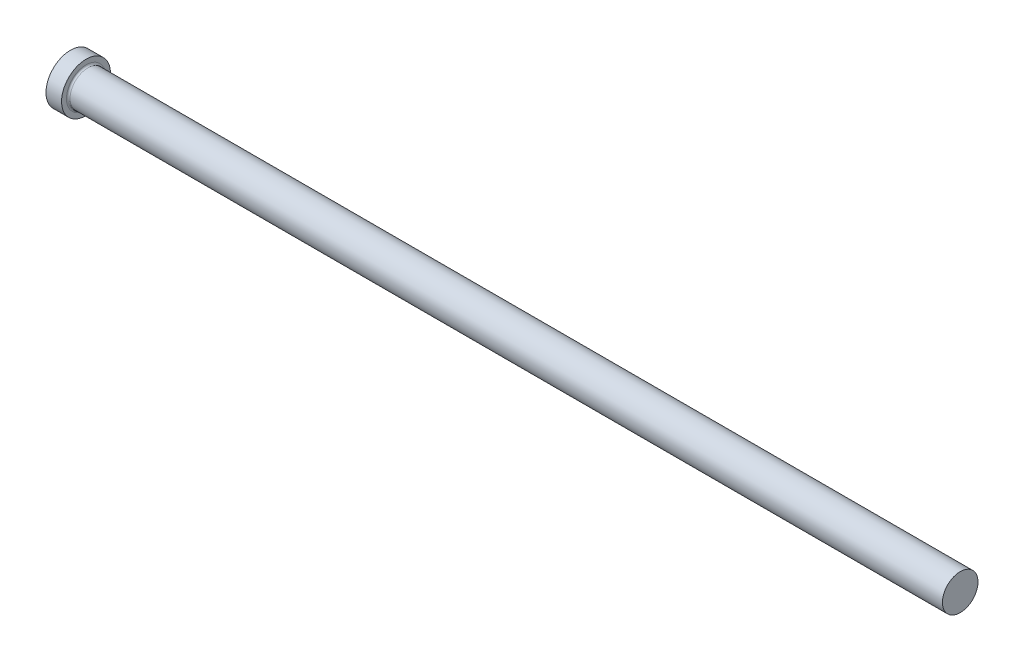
ISO-10303-21;
HEADER;
FILE_DESCRIPTION(('STEP AP214'),'2;1');
FILE_NAME('part.step','',(''),(''),'','','');
FILE_SCHEMA(('AUTOMOTIVE_DESIGN { 1 0 10303 214 1 1 1 1 }'));
ENDSEC;
DATA;
#1=APPLICATION_CONTEXT('core data for automotive mechanical design processes');
#2=APPLICATION_PROTOCOL_DEFINITION('international standard','automotive_design',2000,#1);
#3=PRODUCT_CONTEXT('',#1,'mechanical');
#4=PRODUCT('Part','Part','',(#3));
#5=PRODUCT_RELATED_PRODUCT_CATEGORY('part','',(#4));
#6=PRODUCT_DEFINITION_FORMATION('','',#4);
#7=PRODUCT_DEFINITION_CONTEXT('part definition',#1,'design');
#8=PRODUCT_DEFINITION('design','',#6,#7);
#9=PRODUCT_DEFINITION_SHAPE('','',#8);
#10=(LENGTH_UNIT() NAMED_UNIT(*) SI_UNIT(.MILLI.,.METRE.));
#11=(NAMED_UNIT(*) PLANE_ANGLE_UNIT() SI_UNIT($,.RADIAN.));
#12=(NAMED_UNIT(*) SI_UNIT($,.STERADIAN.) SOLID_ANGLE_UNIT());
#13=UNCERTAINTY_MEASURE_WITH_UNIT(LENGTH_MEASURE(1.E-05),#10,'distance_accuracy_value','');
#14=(GEOMETRIC_REPRESENTATION_CONTEXT(3) GLOBAL_UNCERTAINTY_ASSIGNED_CONTEXT((#13)) GLOBAL_UNIT_ASSIGNED_CONTEXT((#10,
#11,#12)) REPRESENTATION_CONTEXT('',''));
#15=CARTESIAN_POINT('',(0.,0.,0.));
#16=DIRECTION('',(0.,0.,1.));
#17=DIRECTION('',(1.,0.,0.));
#18=AXIS2_PLACEMENT_3D('',#15,#16,#17);
#19=CARTESIAN_POINT('',(0.,0.,0.));
#20=DIRECTION('',(-1.,0.,0.));
#21=DIRECTION('',(0.,-1.,0.));
#22=AXIS2_PLACEMENT_3D('',#19,#20,#21);
#23=PLANE('',#22);
#24=CARTESIAN_POINT('',(0.,0.,0.));
#25=DIRECTION('',(1.,0.,0.));
#26=DIRECTION('',(0.,1.,0.));
#27=AXIS2_PLACEMENT_3D('',#24,#25,#26);
#28=CIRCLE('',#27,11.);
#29=CARTESIAN_POINT('',(0.,11.,0.));
#30=VERTEX_POINT('',#29);
#31=EDGE_CURVE('E25',#30,#30,#28,.T.);
#32=ORIENTED_EDGE('',*,*,#31,.F.);
#33=EDGE_LOOP('',(#32));
#34=FACE_BOUND('',#33,.T.);
#35=ADVANCED_FACE('F14',(#34),#23,.T.);
#36=CARTESIAN_POINT('',(400.,0.,0.));
#37=DIRECTION('',(1.,0.,0.));
#38=DIRECTION('',(0.,1.,0.));
#39=AXIS2_PLACEMENT_3D('',#36,#37,#38);
#40=CYLINDRICAL_SURFACE('',#39,11.);
#41=ORIENTED_EDGE('',*,*,#31,.T.);
#42=EDGE_LOOP('',(#41));
#43=FACE_BOUND('',#42,.T.);
#44=CARTESIAN_POINT('',(7.,0.,0.));
#45=DIRECTION('',(1.,0.,0.));
#46=DIRECTION('',(0.,1.,0.));
#47=AXIS2_PLACEMENT_3D('',#44,#45,#46);
#48=CIRCLE('',#47,11.);
#49=CARTESIAN_POINT('',(7.,11.,0.));
#50=VERTEX_POINT('',#49);
#51=EDGE_CURVE('E29',#50,#50,#48,.T.);
#52=ORIENTED_EDGE('',*,*,#51,.F.);
#53=EDGE_LOOP('',(#52));
#54=FACE_BOUND('',#53,.T.);
#55=ADVANCED_FACE('F51',(#43,#54),#40,.T.);
#56=CARTESIAN_POINT('',(7.,11.,0.));
#57=DIRECTION('',(1.,0.,0.));
#58=DIRECTION('',(0.,1.,0.));
#59=AXIS2_PLACEMENT_3D('',#56,#57,#58);
#60=PLANE('',#59);
#61=CARTESIAN_POINT('',(7.,0.,0.));
#62=DIRECTION('',(1.,0.,0.));
#63=DIRECTION('',(0.,1.,0.));
#64=AXIS2_PLACEMENT_3D('',#61,#62,#63);
#65=CIRCLE('',#64,8.8);
#66=CARTESIAN_POINT('',(7.,8.8,0.));
#67=VERTEX_POINT('',#66);
#68=EDGE_CURVE('E9',#67,#67,#65,.F.);
#69=ORIENTED_EDGE('',*,*,#68,.T.);
#70=EDGE_LOOP('',(#69));
#71=FACE_BOUND('',#70,.T.);
#72=ORIENTED_EDGE('',*,*,#51,.T.);
#73=EDGE_LOOP('',(#72));
#74=FACE_BOUND('',#73,.T.);
#75=ADVANCED_FACE('F42',(#71,#74),#60,.T.);
#76=CARTESIAN_POINT('',(400.,0.,0.));
#77=DIRECTION('',(1.,0.,0.));
#78=DIRECTION('',(0.,1.,0.));
#79=AXIS2_PLACEMENT_3D('',#76,#77,#78);
#80=CYLINDRICAL_SURFACE('',#79,8.);
#81=CARTESIAN_POINT('',(7.8,0.,0.));
#82=DIRECTION('',(1.,0.,0.));
#83=DIRECTION('',(0.,1.,0.));
#84=AXIS2_PLACEMENT_3D('',#81,#82,#83);
#85=CIRCLE('',#84,8.);
#86=CARTESIAN_POINT('',(7.8,8.,0.));
#87=VERTEX_POINT('',#86);
#88=EDGE_CURVE('E21',#87,#87,#85,.T.);
#89=ORIENTED_EDGE('',*,*,#88,.T.);
#90=EDGE_LOOP('',(#89));
#91=FACE_BOUND('',#90,.T.);
#92=CARTESIAN_POINT('',(400.,0.,0.));
#93=DIRECTION('',(1.,0.,0.));
#94=DIRECTION('',(0.,1.,0.));
#95=AXIS2_PLACEMENT_3D('',#92,#93,#94);
#96=CIRCLE('',#95,8.);
#97=CARTESIAN_POINT('',(400.,8.00000000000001,0.));
#98=VERTEX_POINT('',#97);
#99=EDGE_CURVE('E34',#98,#98,#96,.T.);
#100=ORIENTED_EDGE('',*,*,#99,.F.);
#101=EDGE_LOOP('',(#100));
#102=FACE_BOUND('',#101,.T.);
#103=ADVANCED_FACE('F40',(#91,#102),#80,.T.);
#104=CARTESIAN_POINT('',(400.,8.,0.));
#105=DIRECTION('',(1.,0.,0.));
#106=DIRECTION('',(0.,1.,0.));
#107=AXIS2_PLACEMENT_3D('',#104,#105,#106);
#108=PLANE('',#107);
#109=ORIENTED_EDGE('',*,*,#99,.T.);
#110=EDGE_LOOP('',(#109));
#111=FACE_BOUND('',#110,.T.);
#112=ADVANCED_FACE('F38',(#111),#108,.T.);
#113=CARTESIAN_POINT('',(7.8,0.,0.));
#114=DIRECTION('',(1.,0.,0.));
#115=DIRECTION('',(0.,1.,0.));
#116=AXIS2_PLACEMENT_3D('',#113,#114,#115);
#117=TOROIDAL_SURFACE('',#116,8.8,0.8);
#118=ORIENTED_EDGE('',*,*,#68,.F.);
#119=EDGE_LOOP('',(#118));
#120=FACE_BOUND('',#119,.T.);
#121=ORIENTED_EDGE('',*,*,#88,.F.);
#122=EDGE_LOOP('',(#121));
#123=FACE_BOUND('',#122,.T.);
#124=ADVANCED_FACE('F16',(#120,#123),#117,.F.);
#125=CLOSED_SHELL('',(#35,#55,#75,#103,#112,#124));
#126=MANIFOLD_SOLID_BREP('B1',#125);
#127=ADVANCED_BREP_SHAPE_REPRESENTATION('',(#18,#126),#14);
#128=SHAPE_DEFINITION_REPRESENTATION(#9,#127);
ENDSEC;
END-ISO-10303-21;
